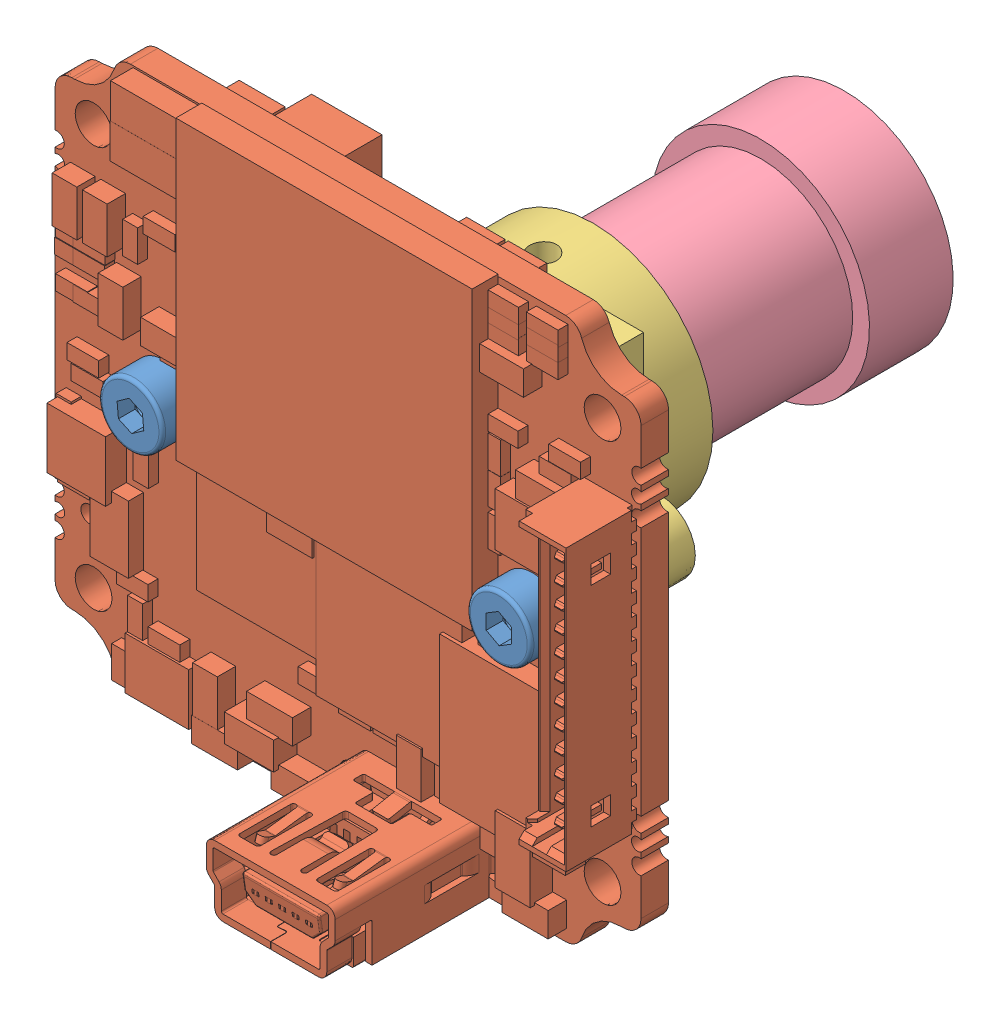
SolidWorks assembly mvBlueFOX-MLC_S-Mount.SLDASM, configuration Default (file format 10000). Lengths in mm.
Overall size (35 32.52 38.84).
5 component instances, 4 part files, 2 mates.
Components (placement in the parent):
- Socket Head Cap Screw_DIN_DIN 912 M2 x 3 --- 3N-1: Socket Head Cap Screw_DIN_DIN 912 M2 x 3 --- 3N.sldprt [Default] at (-11 0 3.6432) x (0 0 -1) z (0.995759 0.091998 0) size (5 3.8 3.8)
- mvBF-MLC-20.04.2010_Default-1: mvBF-MLC-20.04.2010_Default.sldprt [Default] at origin size (35 32.52 13.44)
- Socket Head Cap Screw_DIN_DIN 912 M2 x 3 --- 3N-2: Socket Head Cap Screw_DIN_DIN 912 M2 x 3 --- 3N.sldprt [Default] at (11 0 3.6432) x (0 0 -1) z (0.999692 0.024825 0) size (5 3.8 3.8)
- Lensation-SH02M13_Default-1: Lensation-SH02M13_Default.sldprt [Default] x (0 1 0) z (0 0 -1) size (20 26.2 13)
- MV-O-SMOUNT 05.4-1: MV-O-SMOUNT 05.4.SLDPRT [Default] at (0 0 -28) x (0.447393 -0.894338 0) z (-0.894338 -0.447393 0) size (13 20 13)
Mates (geometry in assembly coordinates):
- Concentric3: concentric aligned: cylinder of Lensation-SH02M13_Default-1 through (0 0 -13) axis (0 0 -1) radius 5.4; cylinder of MV-O-SMOUNT 05.4-1 through (0 0 -8) axis (0 0 -1) radius 5.5
- Distance1: distance = 15 mm aligned: plane of MV-O-SMOUNT 05.4-1 through (0 0 -28) normal (0 0 -1); plane of Lensation-SH02M13_Default-1 through (0 0 -13) normal (0 0 -1)
